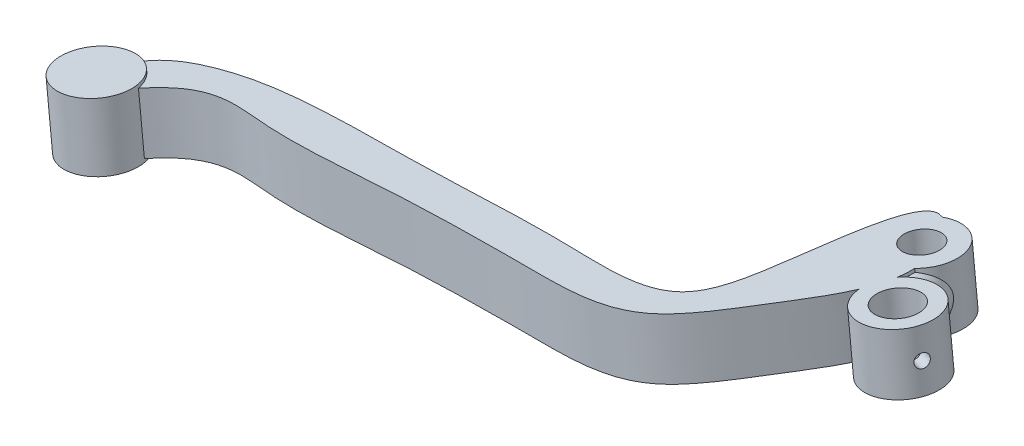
from build123d import *

# Parameters (mm, degrees)
PALANCA_DEPTH                 = 4.5
BUJE_PIVOTE_PROFILE_R         = 5.5
BOLA_PROFILE_R                = 5.5
BRAZO_CABEZAL_PROFILE_R       = 4
OREJA_CABEZAL_PROFILE_R       = 5.5
AGUJERO_PIVOTE_PROFILE_R      = 2.75
ALOJAMIENTO_CABEZAL_PROFILE_R = 3.25
SALIDA_CABLE_PROFILE_R        = 1


with BuildPart() as part:
    # Sk_Palanca → Palanca (new, symmetric)
    with BuildSketch(Plane(origin=(6.614764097, 64.837786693, 0), x_dir=(-0.994836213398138, 0.10149339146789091, 0), z_dir=(-0.1014933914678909, -0.9948362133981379, 0))):
        with BuildLine():
            add(Edge.make_bspline(
                [(-246.267712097, -9.635902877), (-243.886968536, -16.428336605), (-252.167229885, -26.539110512), (-262.150904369, -40.917249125), (-282.597733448, -38.61306643), (-302.067834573, -36.912429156), (-321.774042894, -36.730768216), (-335.8922068, -32.77279684), (-346.42741419, -47.422354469), (-345.126178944, -34.200079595), (-335.600297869, -29.860646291), (-321.07478475, -29.32902891), (-301.354059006, -31.612602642), (-282.725652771, -32.142864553), (-261.071507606, -35.64669483), (-257.235825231, -19.931179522), (-254.911764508, 3.376830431), (-247.263524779, -6.794777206), (-246.267712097, -9.635902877)],
                knots=[0, 0, 0, 0, 0.078945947, 0.135623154, 0.200778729, 0.301383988, 0.381877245, 0.435139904, 0.476711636, 0.50085207, 0.542423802, 0.595686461, 0.676179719, 0.776784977, 0.841940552, 0.8880327, 0.966978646, 1, 1, 1, 1], degree=3))
        make_face()
    extrude(amount=PALANCA_DEPTH, both=True)

    # Buje_pivote: sweep along a curve in space
    with BuildLine() as buje_pivote_path:
        Line((253.82871512, 35.093611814, 8.366303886), (254.742155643, 44.047137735, 8.366303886))
    # Buje_pivote profile (on start of the path) → Buje_pivote (sweep)
    with BuildSketch(Plane(origin=(253.82871512, 35.093611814, 8.366303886), x_dir=(0.9948362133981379, -0.10149339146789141, 0), z_dir=(0.10149339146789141, 0.9948362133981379, 0))):
        Circle(BUJE_PIVOTE_PROFILE_R)
    sweep(path=buje_pivote_path.line)

    # Bola: sweep along a curve in space
    with BuildLine() as bola_path:
        Line((349.354760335, 24.845430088, 40.103497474), (350.369694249, 34.793792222, 40.103497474))
    # Bola profile (on start of the path) → Bola (sweep)
    with BuildSketch(Plane(origin=(349.354760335, 24.845430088, 40.103497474), x_dir=(0.9948362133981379, -0.101493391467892, 0), z_dir=(0.101493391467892, 0.9948362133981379, 0))):
        Circle(BOLA_PROFILE_R)
    sweep(path=bola_path.line)

    # Brazo_cabezal: sweep along a curve in space
    with BuildLine() as brazo_cabezal_path:
        Line((254.285435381, 39.570374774, 8.366303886), (247.241040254, 40.289045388, 19.112001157))
    # Brazo_cabezal profile (on start of the path) → Brazo_cabezal (sweep)
    with BuildSketch(Plane(origin=(254.285435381, 39.570374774, 8.366303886), x_dir=(0.8363144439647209, 0, 0.5482500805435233), z_dir=(-0.5473944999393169, 0.05584529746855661, 0.835009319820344))):
        Circle(BRAZO_CABEZAL_PROFILE_R)
    sweep(path=brazo_cabezal_path.line)

    # Oreja_cabezal: sweep along a curve in space
    with BuildLine() as oreja_cabezal_path:
        Line((246.784319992, 35.812282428, 19.112001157), (247.697760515, 44.765808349, 19.112001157))
    # Oreja_cabezal profile (on start of the path) → Oreja_cabezal (sweep)
    with BuildSketch(Plane(origin=(246.784319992, 35.812282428, 19.112001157), x_dir=(0.9948362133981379, -0.10149339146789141, 0), z_dir=(0.10149339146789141, 0.9948362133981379, 0))):
        Circle(OREJA_CABEZAL_PROFILE_R)
    sweep(path=oreja_cabezal_path.line)

    # Agujero_pivote: sweep along a curve in space
    with BuildLine() as agujero_pivote_path:
        Line((253.473488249, 31.611685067, 8.366303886), (255.097382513, 47.529064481, 8.366303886))
    # Agujero_pivote profile (on start of the path) → Agujero_pivote (sweep, cut)
    with BuildSketch(Plane(origin=(253.473488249, 31.611685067, 8.366303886), x_dir=(0.9948362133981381, -0.10149339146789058, 0), z_dir=(0.10149339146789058, 0.9948362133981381, 0))):
        Circle(AGUJERO_PIVOTE_PROFILE_R)
    sweep(path=agujero_pivote_path.line, mode=Mode.SUBTRACT)

    # Alojamiento_cabezal: sweep along a curve in space
    with BuildLine() as alojamiento_cabezal_path:
        Line((246.632079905, 34.320028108, 19.112001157), (247.850000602, 46.258062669, 19.112001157))
    # Alojamiento_cabezal profile (on start of the path) → Alojamiento_cabezal (sweep, cut)
    with BuildSketch(Plane(origin=(246.632079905, 34.320028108, 19.112001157), x_dir=(0.9948362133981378, -0.10149339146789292, 0), z_dir=(0.10149339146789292, 0.9948362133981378, 0))):
        Circle(ALOJAMIENTO_CABEZAL_PROFILE_R)
    sweep(path=alojamiento_cabezal_path.line, mode=Mode.SUBTRACT)

    # Salida_cable: sweep along a curve in space
    with BuildLine() as salida_cable_path:
        Line((247.241040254, 40.289045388, 19.112001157), (238.545113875, 41.176205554, 22.183452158))
    # Salida_cable profile (on start of the path) → Salida_cable (sweep, cut)
    with BuildSketch(Plane(origin=(247.241040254, 40.289045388, 19.112001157), x_dir=(-0.3330419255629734, 0, -0.9429120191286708), z_dir=(-0.9385793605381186, 0.09575405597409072, 0.33151160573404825))):
        Circle(SALIDA_CABLE_PROFILE_R)
    sweep(path=salida_cable_path.line, mode=Mode.SUBTRACT)


with BuildPart() as body_2:
    # Simetria_lado_izq: mirrored copy
    add(part.part.mirror(Plane(origin=(0, 0, 0), x_dir=(0, 0, 1), z_dir=(1, 0, 0))))


solid = body_2.part
